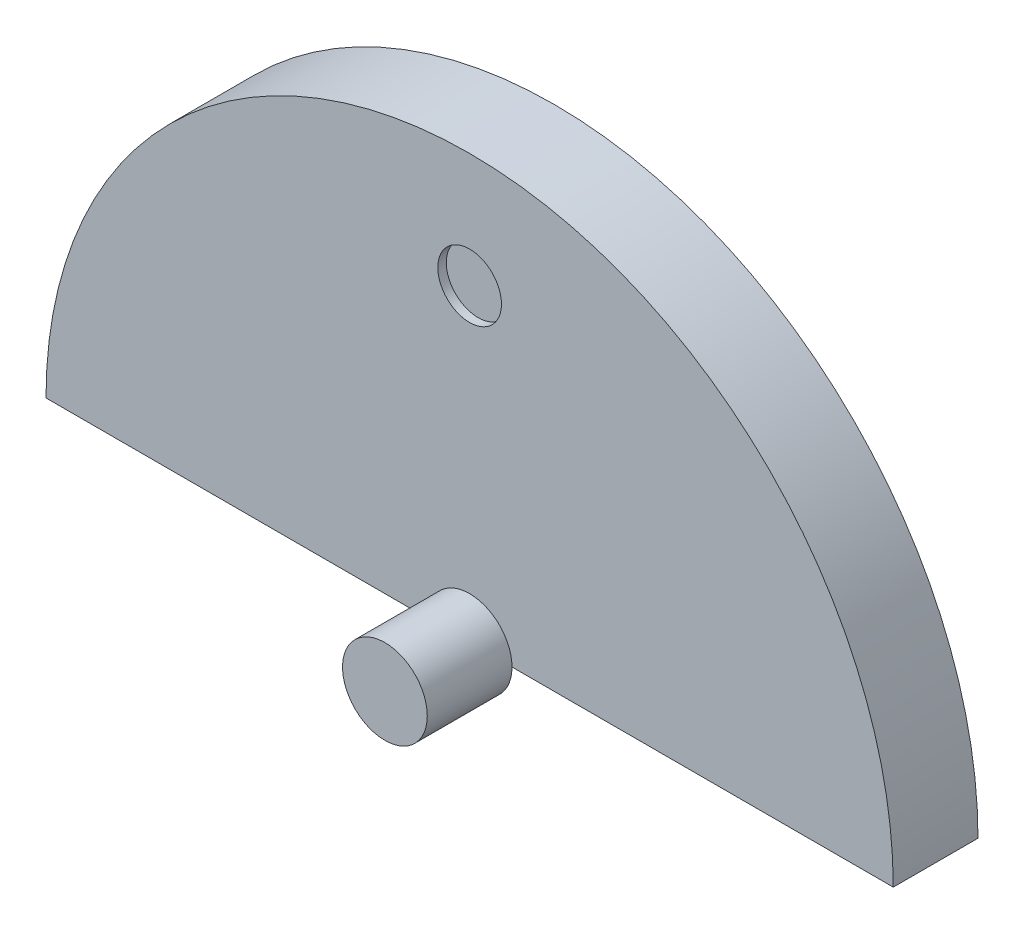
ISO-10303-21;
HEADER;
FILE_DESCRIPTION(('STEP AP214'),'2;1');
FILE_NAME('part.step','',(''),(''),'','','');
FILE_SCHEMA(('AUTOMOTIVE_DESIGN { 1 0 10303 214 1 1 1 1 }'));
ENDSEC;
DATA;
#1=APPLICATION_CONTEXT('core data for automotive mechanical design processes');
#2=APPLICATION_PROTOCOL_DEFINITION('international standard','automotive_design',2000,#1);
#3=PRODUCT_CONTEXT('',#1,'mechanical');
#4=PRODUCT('Part','Part','',(#3));
#5=PRODUCT_RELATED_PRODUCT_CATEGORY('part','',(#4));
#6=PRODUCT_DEFINITION_FORMATION('','',#4);
#7=PRODUCT_DEFINITION_CONTEXT('part definition',#1,'design');
#8=PRODUCT_DEFINITION('design','',#6,#7);
#9=PRODUCT_DEFINITION_SHAPE('','',#8);
#10=(LENGTH_UNIT() NAMED_UNIT(*) SI_UNIT(.MILLI.,.METRE.));
#11=(NAMED_UNIT(*) PLANE_ANGLE_UNIT() SI_UNIT($,.RADIAN.));
#12=(NAMED_UNIT(*) SI_UNIT($,.STERADIAN.) SOLID_ANGLE_UNIT());
#13=UNCERTAINTY_MEASURE_WITH_UNIT(LENGTH_MEASURE(1.E-05),#10,'distance_accuracy_value','');
#14=(GEOMETRIC_REPRESENTATION_CONTEXT(3) GLOBAL_UNCERTAINTY_ASSIGNED_CONTEXT((#13)) GLOBAL_UNIT_ASSIGNED_CONTEXT((#10,
#11,#12)) REPRESENTATION_CONTEXT('',''));
#15=CARTESIAN_POINT('',(0.,0.,0.));
#16=DIRECTION('',(0.,0.,1.));
#17=DIRECTION('',(1.,0.,0.));
#18=AXIS2_PLACEMENT_3D('',#15,#16,#17);
#19=CARTESIAN_POINT('',(0.,0.,100.));
#20=DIRECTION('',(0.,0.,-1.));
#21=DIRECTION('',(-1.,0.,0.));
#22=AXIS2_PLACEMENT_3D('',#19,#20,#21);
#23=CYLINDRICAL_SURFACE('',#22,500.);
#24=CARTESIAN_POINT('',(0.,0.,0.));
#25=DIRECTION('',(0.,0.,1.));
#26=DIRECTION('',(1.,0.,0.));
#27=AXIS2_PLACEMENT_3D('',#24,#25,#26);
#28=CIRCLE('',#27,500.);
#29=CARTESIAN_POINT('',(500.,0.,0.));
#30=VERTEX_POINT('',#29);
#31=CARTESIAN_POINT('',(-500.,0.,0.));
#32=VERTEX_POINT('',#31);
#33=EDGE_CURVE('E73',#30,#32,#28,.T.);
#34=ORIENTED_EDGE('',*,*,#33,.T.);
#35=DIRECTION('',(0.,0.,-1.));
#36=VECTOR('',#35,1.);
#37=CARTESIAN_POINT('',(-500.,0.,100.));
#38=LINE('',#37,#36);
#39=CARTESIAN_POINT('',(-500.,0.,100.));
#40=VERTEX_POINT('',#39);
#41=EDGE_CURVE('E11',#40,#32,#38,.T.);
#42=ORIENTED_EDGE('',*,*,#41,.F.);
#43=CARTESIAN_POINT('',(0.,0.,100.));
#44=DIRECTION('',(0.,0.,1.));
#45=DIRECTION('',(1.,0.,0.));
#46=AXIS2_PLACEMENT_3D('',#43,#44,#45);
#47=CIRCLE('',#46,500.);
#48=CARTESIAN_POINT('',(500.,0.,100.));
#49=VERTEX_POINT('',#48);
#50=EDGE_CURVE('E72',#49,#40,#47,.T.);
#51=ORIENTED_EDGE('',*,*,#50,.F.);
#52=DIRECTION('',(0.,0.,-1.));
#53=VECTOR('',#52,1.);
#54=CARTESIAN_POINT('',(500.,0.,100.));
#55=LINE('',#54,#53);
#56=EDGE_CURVE('E40',#49,#30,#55,.T.);
#57=ORIENTED_EDGE('',*,*,#56,.T.);
#58=EDGE_LOOP('',(#34,#42,#51,#57));
#59=FACE_BOUND('',#58,.T.);
#60=ADVANCED_FACE('F33',(#59),#23,.T.);
#61=CARTESIAN_POINT('',(-500.,0.,100.));
#62=DIRECTION('',(0.,1.,0.));
#63=DIRECTION('',(0.,0.,1.));
#64=AXIS2_PLACEMENT_3D('',#61,#62,#63);
#65=PLANE('',#64);
#66=DIRECTION('',(1.,0.,0.));
#67=VECTOR('',#66,1.);
#68=CARTESIAN_POINT('',(-500.,0.,0.));
#69=LINE('',#68,#67);
#70=EDGE_CURVE('E64',#32,#30,#69,.T.);
#71=ORIENTED_EDGE('',*,*,#70,.T.);
#72=ORIENTED_EDGE('',*,*,#56,.F.);
#73=DIRECTION('',(1.,0.,0.));
#74=VECTOR('',#73,1.);
#75=CARTESIAN_POINT('',(-500.,0.,100.));
#76=LINE('',#75,#74);
#77=CARTESIAN_POINT('',(50.,0.,100.));
#78=VERTEX_POINT('',#77);
#79=EDGE_CURVE('E52',#78,#49,#76,.T.);
#80=ORIENTED_EDGE('',*,*,#79,.F.);
#81=CARTESIAN_POINT('',(-50.,0.,100.));
#82=VERTEX_POINT('',#81);
#83=EDGE_CURVE('E84',#82,#78,#76,.T.);
#84=ORIENTED_EDGE('',*,*,#83,.F.);
#85=EDGE_CURVE('E76',#40,#82,#76,.T.);
#86=ORIENTED_EDGE('',*,*,#85,.F.);
#87=ORIENTED_EDGE('',*,*,#41,.T.);
#88=EDGE_LOOP('',(#71,#72,#80,#84,#86,#87));
#89=FACE_BOUND('',#88,.T.);
#90=ADVANCED_FACE('F66',(#89),#65,.F.);
#91=CARTESIAN_POINT('',(0.,0.,100.));
#92=DIRECTION('',(0.,0.,1.));
#93=DIRECTION('',(1.,0.,0.));
#94=AXIS2_PLACEMENT_3D('',#91,#92,#93);
#95=PLANE('',#94);
#96=CARTESIAN_POINT('',(0.,364.679377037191,100.));
#97=DIRECTION('',(0.,0.,1.));
#98=DIRECTION('',(1.,0.,0.));
#99=AXIS2_PLACEMENT_3D('',#96,#97,#98);
#100=CIRCLE('',#99,37.5589742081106);
#101=CARTESIAN_POINT('',(37.5589742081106,364.679377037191,100.));
#102=VERTEX_POINT('',#101);
#103=EDGE_CURVE('E88',#102,#102,#100,.T.);
#104=ORIENTED_EDGE('',*,*,#103,.F.);
#105=EDGE_LOOP('',(#104));
#106=FACE_BOUND('',#105,.T.);
#107=CARTESIAN_POINT('',(0.,0.,100.));
#108=DIRECTION('',(0.,0.,1.));
#109=DIRECTION('',(1.,0.,0.));
#110=AXIS2_PLACEMENT_3D('',#107,#108,#109);
#111=CIRCLE('',#110,50.);
#112=EDGE_CURVE('E47',#78,#82,#111,.T.);
#113=ORIENTED_EDGE('',*,*,#112,.F.);
#114=ORIENTED_EDGE('',*,*,#79,.T.);
#115=ORIENTED_EDGE('',*,*,#50,.T.);
#116=ORIENTED_EDGE('',*,*,#85,.T.);
#117=EDGE_LOOP('',(#113,#114,#115,#116));
#118=FACE_BOUND('',#117,.T.);
#119=ADVANCED_FACE('F103',(#106,#118),#95,.T.);
#120=CARTESIAN_POINT('',(0.,0.,0.));
#121=DIRECTION('',(0.,0.,1.));
#122=DIRECTION('',(1.,0.,0.));
#123=AXIS2_PLACEMENT_3D('',#120,#121,#122);
#124=PLANE('',#123);
#125=ORIENTED_EDGE('',*,*,#33,.F.);
#126=ORIENTED_EDGE('',*,*,#70,.F.);
#127=EDGE_LOOP('',(#125,#126));
#128=FACE_BOUND('',#127,.T.);
#129=ADVANCED_FACE('F77',(#128),#124,.F.);
#130=CARTESIAN_POINT('',(0.,0.,100.));
#131=DIRECTION('',(0.,0.,1.));
#132=DIRECTION('',(1.,0.,0.));
#133=AXIS2_PLACEMENT_3D('',#130,#131,#132);
#134=PLANE('',#133);
#135=EDGE_CURVE('E86',#82,#78,#111,.T.);
#136=ORIENTED_EDGE('',*,*,#135,.F.);
#137=ORIENTED_EDGE('',*,*,#83,.T.);
#138=EDGE_LOOP('',(#136,#137));
#139=FACE_BOUND('',#138,.T.);
#140=ADVANCED_FACE('F101',(#139),#134,.F.);
#141=CARTESIAN_POINT('',(0.,0.,200.));
#142=DIRECTION('',(0.,0.,-1.));
#143=DIRECTION('',(-1.,0.,0.));
#144=AXIS2_PLACEMENT_3D('',#141,#142,#143);
#145=CYLINDRICAL_SURFACE('',#144,50.);
#146=CARTESIAN_POINT('',(0.,0.,200.));
#147=DIRECTION('',(0.,0.,1.));
#148=DIRECTION('',(1.,0.,0.));
#149=AXIS2_PLACEMENT_3D('',#146,#147,#148);
#150=CIRCLE('',#149,50.);
#151=CARTESIAN_POINT('',(50.,0.,200.));
#152=VERTEX_POINT('',#151);
#153=EDGE_CURVE('E78',#152,#152,#150,.T.);
#154=ORIENTED_EDGE('',*,*,#153,.F.);
#155=EDGE_LOOP('',(#154));
#156=FACE_BOUND('',#155,.T.);
#157=ORIENTED_EDGE('',*,*,#112,.T.);
#158=ORIENTED_EDGE('',*,*,#135,.T.);
#159=EDGE_LOOP('',(#157,#158));
#160=FACE_BOUND('',#159,.T.);
#161=ADVANCED_FACE('F98',(#156,#160),#145,.T.);
#162=CARTESIAN_POINT('',(0.,0.,200.));
#163=DIRECTION('',(0.,0.,1.));
#164=DIRECTION('',(1.,0.,0.));
#165=AXIS2_PLACEMENT_3D('',#162,#163,#164);
#166=PLANE('',#165);
#167=ORIENTED_EDGE('',*,*,#153,.T.);
#168=EDGE_LOOP('',(#167));
#169=FACE_BOUND('',#168,.T.);
#170=ADVANCED_FACE('F142',(#169),#166,.T.);
#171=CARTESIAN_POINT('',(0.,364.679377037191,90.));
#172=DIRECTION('',(0.,0.,1.));
#173=DIRECTION('',(1.,0.,0.));
#174=AXIS2_PLACEMENT_3D('',#171,#172,#173);
#175=CYLINDRICAL_SURFACE('',#174,37.5589742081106);
#176=CARTESIAN_POINT('',(0.,364.679377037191,90.));
#177=DIRECTION('',(0.,0.,1.));
#178=DIRECTION('',(1.,0.,0.));
#179=AXIS2_PLACEMENT_3D('',#176,#177,#178);
#180=CIRCLE('',#179,37.5589742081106);
#181=CARTESIAN_POINT('',(37.5589742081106,364.679377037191,90.));
#182=VERTEX_POINT('',#181);
#183=EDGE_CURVE('E91',#182,#182,#180,.T.);
#184=ORIENTED_EDGE('',*,*,#183,.F.);
#185=EDGE_LOOP('',(#184));
#186=FACE_BOUND('',#185,.T.);
#187=ORIENTED_EDGE('',*,*,#103,.T.);
#188=EDGE_LOOP('',(#187));
#189=FACE_BOUND('',#188,.T.);
#190=ADVANCED_FACE('F150',(#186,#189),#175,.F.);
#191=CARTESIAN_POINT('',(0.,364.679377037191,90.));
#192=DIRECTION('',(0.,0.,1.));
#193=DIRECTION('',(1.,0.,0.));
#194=AXIS2_PLACEMENT_3D('',#191,#192,#193);
#195=PLANE('',#194);
#196=ORIENTED_EDGE('',*,*,#183,.T.);
#197=EDGE_LOOP('',(#196));
#198=FACE_BOUND('',#197,.T.);
#199=ADVANCED_FACE('F164',(#198),#195,.T.);
#200=CLOSED_SHELL('',(#60,#90,#119,#129,#140,#161,#170,#190,#199));
#201=MANIFOLD_SOLID_BREP('B2',#200);
#202=ADVANCED_BREP_SHAPE_REPRESENTATION('',(#18,#201),#14);
#203=SHAPE_DEFINITION_REPRESENTATION(#9,#202);
ENDSEC;
END-ISO-10303-21;
